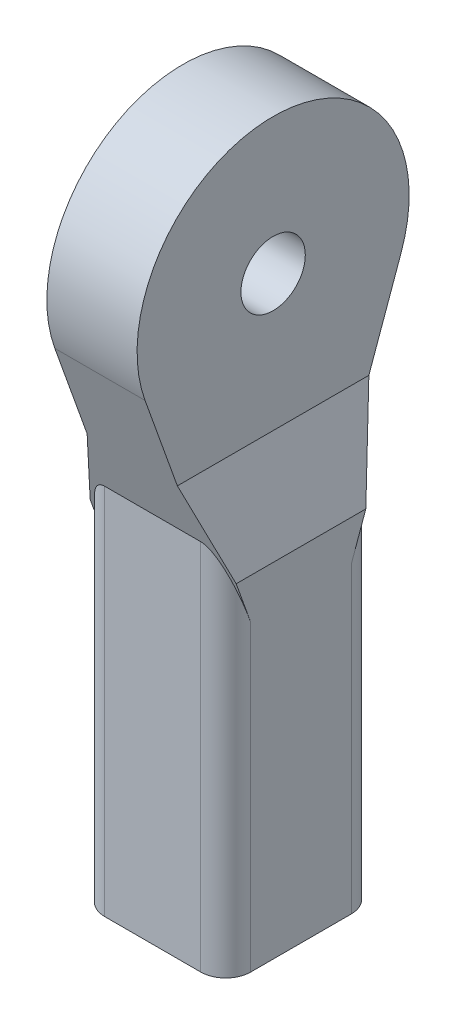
from build123d import *

# Parameters (mm, degrees)
BOSS_EXTRUDE1_DEPTH     = 4.0894
SKETCH2_R               = 0.9
CUT_EXTRUDE1_DEPTH      = 2.54
FILLET1_R               = 0.7
CUT_EXTRUDE2_DEPTH      = 15.746009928
CUT_EXTRUDE2_DEPTH_BACK = 15.746009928
CUT_EXTRUDE3_DEPTH      = 15.548773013
CUT_EXTRUDE3_DEPTH_BACK = 15.548773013
SKETCH4_R               = 0.9017


with BuildPart() as part:
    # Sketch1 → Boss-Extrude1 (new body)
    with BuildSketch(Plane(origin=(0, 0, 0), x_dir=(0, 0, -1), z_dir=(1, 0, 0))):
        with BuildLine():
            Line((-1.2404, -6.2865), (2.976, -6.2865))
            Line((2.976, -6.2865), (2.976, 4.1529))
            Line((2.976, 4.1529), (4.454380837, 8.277589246))
            ThreePointArc((4.454380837, 8.277589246), (0.8678, 13.3731), (-2.718780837, 8.277589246))
            Line((-2.718780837, 8.277589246), (-1.2404, 4.1529))
            Line((-1.2404, 4.1529), (-1.2404, -6.2865))
        make_face()
    extrude(amount=BOSS_EXTRUDE1_DEPTH)

    # Sketch2 → Cut-Extrude1 (cut)
    with BuildSketch(Plane.XZ.offset(6.2865)):
        with Locations(Location((2.0447, -0.8678, 0), (0, 0, 270))):
            Circle(SKETCH2_R)
    extrude(amount=-CUT_EXTRUDE1_DEPTH, mode=Mode.SUBTRACT)

    # Fillet1
    fillet1_edges = [part.edges().sort_by_distance(p)[0] for p in [
        (4.0894, -1.0668, 1.2404),
        (4.0894, -1.0668, -2.976),
        (0, -1.0668, 1.2404),
        (0, -1.0668, -2.976),
    ]]
    fillet(fillet1_edges, radius=FILLET1_R)

    # Sketch3 → Cut-Extrude2 (cut, two sides: drawn at the far end of the back side and taken through both)
    with BuildSketch(Plane.XY.offset(-CUT_EXTRUDE2_DEPTH_BACK)):
        Polygon((3.30835, 13.3731), (3.30835, 5.7531), (4.0894, 3.336167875), (5.118299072, 13.3731), align=None)
        Polygon((0.78105, 13.3731), (0.78105, 5.7531), (0, 3.336167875), (-0.832405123, 13.3731), align=None)
    extrude(amount=CUT_EXTRUDE2_DEPTH + CUT_EXTRUDE2_DEPTH_BACK, mode=Mode.SUBTRACT)

    # Sketch4 → Cut-Extrude3 (cut, two sides: drawn at the far end of the back side and taken through both)
    with BuildSketch(Plane(origin=(3.30835, 0, 0), x_dir=(0, 0, -1), z_dir=(1, 0, 0)).offset(-CUT_EXTRUDE3_DEPTH_BACK)):
        with Locations(Location((0.8678, 9.5631, 0), (0, 0, 90))):
            Circle(SKETCH4_R)
    extrude(amount=CUT_EXTRUDE3_DEPTH + CUT_EXTRUDE3_DEPTH_BACK, mode=Mode.SUBTRACT)


solid = part.part
